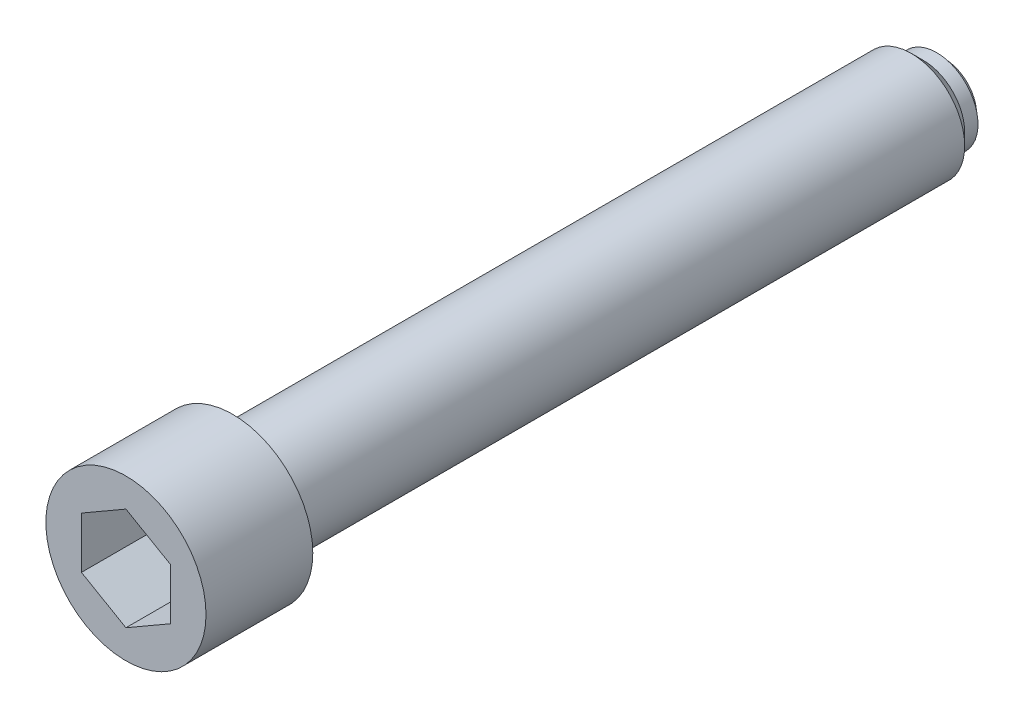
ISO-10303-21;
HEADER;
FILE_DESCRIPTION(('STEP AP214'),'2;1');
FILE_NAME('part.step','',(''),(''),'','','');
FILE_SCHEMA(('AUTOMOTIVE_DESIGN { 1 0 10303 214 1 1 1 1 }'));
ENDSEC;
DATA;
#1=APPLICATION_CONTEXT('core data for automotive mechanical design processes');
#2=APPLICATION_PROTOCOL_DEFINITION('international standard','automotive_design',2000,#1);
#3=PRODUCT_CONTEXT('',#1,'mechanical');
#4=PRODUCT('Part','Part','',(#3));
#5=PRODUCT_RELATED_PRODUCT_CATEGORY('part','',(#4));
#6=PRODUCT_DEFINITION_FORMATION('','',#4);
#7=PRODUCT_DEFINITION_CONTEXT('part definition',#1,'design');
#8=PRODUCT_DEFINITION('design','',#6,#7);
#9=PRODUCT_DEFINITION_SHAPE('','',#8);
#10=(LENGTH_UNIT() NAMED_UNIT(*) SI_UNIT(.MILLI.,.METRE.));
#11=(NAMED_UNIT(*) PLANE_ANGLE_UNIT() SI_UNIT($,.RADIAN.));
#12=(NAMED_UNIT(*) SI_UNIT($,.STERADIAN.) SOLID_ANGLE_UNIT());
#13=UNCERTAINTY_MEASURE_WITH_UNIT(LENGTH_MEASURE(1.E-05),#10,'distance_accuracy_value','');
#14=(GEOMETRIC_REPRESENTATION_CONTEXT(3) GLOBAL_UNCERTAINTY_ASSIGNED_CONTEXT((#13)) GLOBAL_UNIT_ASSIGNED_CONTEXT((#10,
#11,#12)) REPRESENTATION_CONTEXT('',''));
#15=CARTESIAN_POINT('',(0.,0.,0.));
#16=DIRECTION('',(0.,0.,1.));
#17=DIRECTION('',(1.,0.,0.));
#18=AXIS2_PLACEMENT_3D('',#15,#16,#17);
#19=CARTESIAN_POINT('',(0.,0.,2.25887139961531));
#20=DIRECTION('',(0.,0.,1.));
#21=DIRECTION('',(-1.,0.,0.));
#22=AXIS2_PLACEMENT_3D('',#19,#20,#21);
#23=SPHERICAL_SURFACE('',#22,4.25);
#24=CARTESIAN_POINT('',(0.,0.,0.9));
#25=DIRECTION('',(0.,0.,1.));
#26=DIRECTION('',(1.,0.,0.));
#27=AXIS2_PLACEMENT_3D('',#24,#25,#26);
#28=CIRCLE('',#27,4.02690557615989);
#29=CARTESIAN_POINT('',(-4.02690557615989,0.,0.9));
#30=VERTEX_POINT('',#29);
#31=EDGE_CURVE('E132',#30,#30,#28,.T.);
#32=CARTESIAN_POINT('',(0.,0.,0.));
#33=DIRECTION('',(0.,0.,1.));
#34=DIRECTION('',(1.,0.,0.));
#35=AXIS2_PLACEMENT_3D('',#32,#33,#34);
#36=CIRCLE('',#35,3.6);
#37=CARTESIAN_POINT('',(-3.60000000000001,0.,0.));
#38=VERTEX_POINT('',#37);
#39=EDGE_CURVE('E10',#38,#38,#36,.T.);
#40=CARTESIAN_POINT('',(-4.02690557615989,0.,0.9));
#41=CARTESIAN_POINT('',(-4.02358030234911,0.,0.890145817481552));
#42=CARTESIAN_POINT('',(-4.0202188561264,0.,0.880303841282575));
#43=CARTESIAN_POINT('',(-4.01342380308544,0.,0.860644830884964));
#44=CARTESIAN_POINT('',(-4.00999019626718,0.,0.850827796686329));
#45=CARTESIAN_POINT('',(-4.00305100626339,0.,0.831219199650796));
#46=CARTESIAN_POINT('',(-3.99954542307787,0.,0.821427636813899));
#47=CARTESIAN_POINT('',(-3.99246246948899,0.,0.801870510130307));
#48=CARTESIAN_POINT('',(-3.98888509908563,0.,0.792104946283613));
#49=CARTESIAN_POINT('',(-3.98165876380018,0.,0.772600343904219));
#50=CARTESIAN_POINT('',(-3.97800979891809,0.,0.76286130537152));
#51=CARTESIAN_POINT('',(-3.97064047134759,0.,0.743410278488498));
#52=CARTESIAN_POINT('',(-3.96692010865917,0.,0.733698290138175));
#53=CARTESIAN_POINT('',(-3.95940818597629,0.,0.714301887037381));
#54=CARTESIAN_POINT('',(-3.95561662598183,0.,0.704617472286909));
#55=CARTESIAN_POINT('',(-3.94796251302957,0.,0.685276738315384));
#56=CARTESIAN_POINT('',(-3.94409996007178,0.,0.675620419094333));
#57=CARTESIAN_POINT('',(-3.93630406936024,0.,0.656336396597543));
#58=CARTESIAN_POINT('',(-3.9323707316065,0.,0.646708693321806));
#59=CARTESIAN_POINT('',(-3.92443348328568,0.,0.627482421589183));
#60=CARTESIAN_POINT('',(-3.92042957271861,0.,0.617883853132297));
#61=CARTESIAN_POINT('',(-3.91235139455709,0.,0.598716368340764));
#62=CARTESIAN_POINT('',(-3.90827712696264,0.,0.589147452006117));
#63=CARTESIAN_POINT('',(-3.90005845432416,0.,0.570039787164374));
#64=CARTESIAN_POINT('',(-3.89591404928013,0.,0.560501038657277));
#65=CARTESIAN_POINT('',(-3.88755532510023,0.,0.54145422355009));
#66=CARTESIAN_POINT('',(-3.88334100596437,0.,0.53194615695));
#67=CARTESIAN_POINT('',(-3.87484268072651,0.,0.512961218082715));
#68=CARTESIAN_POINT('',(-3.87055867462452,0.,0.503484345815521));
#69=CARTESIAN_POINT('',(-3.86192120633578,0.,0.484562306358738));
#70=CARTESIAN_POINT('',(-3.85756774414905,0.,0.475117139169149));
#71=CARTESIAN_POINT('',(-3.84879159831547,0.,0.456259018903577));
#72=CARTESIAN_POINT('',(-3.84436891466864,0.,0.446846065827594));
#73=CARTESIAN_POINT('',(-3.83545456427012,0.,0.428052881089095));
#74=CARTESIAN_POINT('',(-3.83096289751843,0.,0.418672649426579));
#75=CARTESIAN_POINT('',(-3.82191082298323,0.,0.399945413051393));
#76=CARTESIAN_POINT('',(-3.81735041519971,0.,0.390598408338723));
#77=CARTESIAN_POINT('',(-3.80816110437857,0.,0.371938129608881));
#78=CARTESIAN_POINT('',(-3.80353220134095,0.,0.362624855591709));
#79=CARTESIAN_POINT('',(-3.7942061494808,0.,0.344032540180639));
#80=CARTESIAN_POINT('',(-3.78950900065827,0.,0.334753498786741));
#81=CARTESIAN_POINT('',(-3.78004671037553,0.,0.31623014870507));
#82=CARTESIAN_POINT('',(-3.77528156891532,0.,0.306985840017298));
#83=CARTESIAN_POINT('',(-3.76568355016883,0.,0.288532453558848));
#84=CARTESIAN_POINT('',(-3.76085067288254,0.,0.279323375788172));
#85=CARTESIAN_POINT('',(-3.75111744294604,0.,0.260940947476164));
#86=CARTESIAN_POINT('',(-3.74621709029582,0.,0.251767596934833));
#87=CARTESIAN_POINT('',(-3.73634917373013,0.,0.233457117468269));
#88=CARTESIAN_POINT('',(-3.73138160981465,0.,0.224319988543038));
#89=CARTESIAN_POINT('',(-3.72137953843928,0.,0.206082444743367));
#90=CARTESIAN_POINT('',(-3.71634503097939,0.,0.196982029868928));
#91=CARTESIAN_POINT('',(-3.70620934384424,0.,0.178818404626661));
#92=CARTESIAN_POINT('',(-3.70110816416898,0.,0.169755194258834));
#93=CARTESIAN_POINT('',(-3.69083940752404,0.,0.151666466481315));
#94=CARTESIAN_POINT('',(-3.68567183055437,0.,0.142640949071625));
#95=CARTESIAN_POINT('',(-3.67527055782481,0.,0.124628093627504));
#96=CARTESIAN_POINT('',(-3.67003686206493,0.,0.115640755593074));
#97=CARTESIAN_POINT('',(-3.6595036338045,0.,0.0977047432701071));
#98=CARTESIAN_POINT('',(-3.65420410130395,0.,0.0887560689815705));
#99=CARTESIAN_POINT('',(-3.64353948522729,0.,0.0708978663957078));
#100=CARTESIAN_POINT('',(-3.63817440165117,0.,0.0619883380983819));
#101=CARTESIAN_POINT('',(-3.62737897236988,0.,0.0442089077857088));
#102=CARTESIAN_POINT('',(-3.62194862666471,0.,0.0353390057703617));
#103=CARTESIAN_POINT('',(-3.61102296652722,0.,0.0176393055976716));
#104=CARTESIAN_POINT('',(-3.60552765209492,0.,0.00880950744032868));
#105=CARTESIAN_POINT('',(-3.60000000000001,0.,0.));
#106=B_SPLINE_CURVE_WITH_KNOTS('',3,(#40,#41,#42,#43,#44,#45,#46,#47,#48,#49,#50,#51,#52,#53,
#54,#55,#56,#57,#58,#59,#60,#61,#62,#63,#64,#65,#66,#67,#68,#69,#70,#71,#72,#73,#74,#75,#76,#77,
#78,#79,#80,#81,#82,#83,#84,#85,#86,#87,#88,#89,#90,#91,#92,#93,#94,#95,#96,#97,#98,#99,#100,
#101,#102,#103,#104,#105),.UNSPECIFIED.,.F.,.F.,(4,2,2,2,2,2,2,2,2,2,2,2,2,2,2,2,2,2,2,2,2,2,2,
2,2,2,2,2,2,2,2,2,4),(0.,0.0312002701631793,0.0624005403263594,0.0936008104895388,
0.124801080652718,0.156001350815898,0.187201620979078,0.218401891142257,0.249602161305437,
0.280802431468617,0.312002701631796,0.343202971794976,0.374403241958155,0.405603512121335,
0.436803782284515,0.468004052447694,0.499204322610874,0.530404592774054,0.561604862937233,
0.592805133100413,0.624005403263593,0.655205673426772,0.686405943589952,0.717606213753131,
0.748806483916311,0.780006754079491,0.811207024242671,0.84240729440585,0.87360756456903,
0.904807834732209,0.936008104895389,0.967208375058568,0.998408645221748),.UNSPECIFIED.);
#107=EDGE_CURVE('BSEAM16',#30,#38,#106,.T.);
#108=ORIENTED_EDGE('',*,*,#31,.F.);
#109=ORIENTED_EDGE('',*,*,#39,.T.);
#110=ORIENTED_EDGE('',*,*,#107,.T.);
#111=ORIENTED_EDGE('',*,*,#107,.F.);
#112=EDGE_LOOP('',(#108,#110,#109,#111));
#113=FACE_BOUND('',#112,.T.);
#114=ADVANCED_FACE('F16',(#113),#23,.T.);
#115=CARTESIAN_POINT('',(0.,0.,0.));
#116=DIRECTION('',(0.,0.,1.));
#117=DIRECTION('',(1.,0.,0.));
#118=AXIS2_PLACEMENT_3D('',#115,#116,#117);
#119=PLANE('',#118);
#120=ORIENTED_EDGE('',*,*,#39,.F.);
#121=EDGE_LOOP('',(#120));
#122=FACE_BOUND('',#121,.T.);
#123=ADVANCED_FACE('F208',(#122),#119,.F.);
#124=CARTESIAN_POINT('',(-9.,0.,92.));
#125=DIRECTION('',(0.,0.,-1.));
#126=DIRECTION('',(-1.,0.,0.));
#127=AXIS2_PLACEMENT_3D('',#124,#125,#126);
#128=PLANE('',#127);
#129=DIRECTION('',(-0.866025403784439,-0.5,0.));
#130=VECTOR('',#129,1.);
#131=CARTESIAN_POINT('',(0.,5.77350269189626,92.));
#132=LINE('',#131,#130);
#133=CARTESIAN_POINT('',(0.,5.77350269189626,92.));
#134=VERTEX_POINT('',#133);
#135=CARTESIAN_POINT('',(-5.,2.88675134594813,92.));
#136=VERTEX_POINT('',#135);
#137=EDGE_CURVE('E113',#134,#136,#132,.T.);
#138=ORIENTED_EDGE('',*,*,#137,.F.);
#139=DIRECTION('',(-0.866025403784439,0.5,0.));
#140=VECTOR('',#139,1.);
#141=CARTESIAN_POINT('',(5.,2.88675134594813,92.));
#142=LINE('',#141,#140);
#143=CARTESIAN_POINT('',(5.,2.88675134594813,92.));
#144=VERTEX_POINT('',#143);
#145=EDGE_CURVE('E31',#144,#134,#142,.T.);
#146=ORIENTED_EDGE('',*,*,#145,.F.);
#147=DIRECTION('',(0.,1.,0.));
#148=VECTOR('',#147,1.);
#149=CARTESIAN_POINT('',(5.,-2.88675134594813,92.));
#150=LINE('',#149,#148);
#151=CARTESIAN_POINT('',(5.,-2.88675134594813,92.));
#152=VERTEX_POINT('',#151);
#153=EDGE_CURVE('E126',#152,#144,#150,.T.);
#154=ORIENTED_EDGE('',*,*,#153,.F.);
#155=DIRECTION('',(0.866025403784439,0.5,0.));
#156=VECTOR('',#155,1.);
#157=CARTESIAN_POINT('',(0.,-5.77350269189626,92.));
#158=LINE('',#157,#156);
#159=CARTESIAN_POINT('',(0.,-5.77350269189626,92.));
#160=VERTEX_POINT('',#159);
#161=EDGE_CURVE('E123',#160,#152,#158,.T.);
#162=ORIENTED_EDGE('',*,*,#161,.F.);
#163=DIRECTION('',(0.866025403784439,-0.5,0.));
#164=VECTOR('',#163,1.);
#165=CARTESIAN_POINT('',(-5.,-2.88675134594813,92.));
#166=LINE('',#165,#164);
#167=CARTESIAN_POINT('',(-5.,-2.88675134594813,92.));
#168=VERTEX_POINT('',#167);
#169=EDGE_CURVE('E79',#168,#160,#166,.T.);
#170=ORIENTED_EDGE('',*,*,#169,.F.);
#171=DIRECTION('',(0.,-1.,0.));
#172=VECTOR('',#171,1.);
#173=CARTESIAN_POINT('',(-5.,2.88675134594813,92.));
#174=LINE('',#173,#172);
#175=EDGE_CURVE('E117',#136,#168,#174,.T.);
#176=ORIENTED_EDGE('',*,*,#175,.F.);
#177=EDGE_LOOP('',(#138,#146,#154,#162,#170,#176));
#178=FACE_BOUND('',#177,.T.);
#179=CARTESIAN_POINT('',(0.,0.,92.));
#180=DIRECTION('',(0.,0.,1.));
#181=DIRECTION('',(1.,0.,0.));
#182=AXIS2_PLACEMENT_3D('',#179,#180,#181);
#183=CIRCLE('',#182,9.);
#184=CARTESIAN_POINT('',(9.,0.,92.));
#185=VERTEX_POINT('',#184);
#186=EDGE_CURVE('E24',#185,#185,#183,.T.);
#187=ORIENTED_EDGE('',*,*,#186,.T.);
#188=EDGE_LOOP('',(#187));
#189=FACE_BOUND('',#188,.T.);
#190=ADVANCED_FACE('F167',(#178,#189),#128,.F.);
#191=CARTESIAN_POINT('',(0.,0.,0.));
#192=DIRECTION('',(0.,0.,1.));
#193=DIRECTION('',(1.,0.,0.));
#194=AXIS2_PLACEMENT_3D('',#191,#192,#193);
#195=CYLINDRICAL_SURFACE('',#194,9.);
#196=ORIENTED_EDGE('',*,*,#186,.F.);
#197=EDGE_LOOP('',(#196));
#198=FACE_BOUND('',#197,.T.);
#199=CARTESIAN_POINT('',(0.,0.,80.));
#200=DIRECTION('',(0.,0.,1.));
#201=DIRECTION('',(1.,0.,0.));
#202=AXIS2_PLACEMENT_3D('',#199,#200,#201);
#203=CIRCLE('',#202,9.);
#204=CARTESIAN_POINT('',(9.,0.,80.));
#205=VERTEX_POINT('',#204);
#206=EDGE_CURVE('E160',#205,#205,#203,.T.);
#207=ORIENTED_EDGE('',*,*,#206,.T.);
#208=EDGE_LOOP('',(#207));
#209=FACE_BOUND('',#208,.T.);
#210=ADVANCED_FACE('F169',(#198,#209),#195,.T.);
#211=CARTESIAN_POINT('',(-6.,0.,80.));
#212=DIRECTION('',(0.,0.,1.));
#213=DIRECTION('',(1.,0.,0.));
#214=AXIS2_PLACEMENT_3D('',#211,#212,#213);
#215=PLANE('',#214);
#216=ORIENTED_EDGE('',*,*,#206,.F.);
#217=EDGE_LOOP('',(#216));
#218=FACE_BOUND('',#217,.T.);
#219=CARTESIAN_POINT('',(0.,0.,80.));
#220=DIRECTION('',(0.,0.,1.));
#221=DIRECTION('',(1.,0.,0.));
#222=AXIS2_PLACEMENT_3D('',#219,#220,#221);
#223=CIRCLE('',#222,6.);
#224=CARTESIAN_POINT('',(6.,0.,80.));
#225=VERTEX_POINT('',#224);
#226=EDGE_CURVE('E156',#225,#225,#223,.T.);
#227=ORIENTED_EDGE('',*,*,#226,.T.);
#228=EDGE_LOOP('',(#227));
#229=FACE_BOUND('',#228,.T.);
#230=ADVANCED_FACE('F172',(#218,#229),#215,.F.);
#231=CARTESIAN_POINT('',(0.,0.,0.));
#232=DIRECTION('',(0.,0.,1.));
#233=DIRECTION('',(1.,0.,0.));
#234=AXIS2_PLACEMENT_3D('',#231,#232,#233);
#235=CYLINDRICAL_SURFACE('',#234,6.);
#236=ORIENTED_EDGE('',*,*,#226,.F.);
#237=EDGE_LOOP('',(#236));
#238=FACE_BOUND('',#237,.T.);
#239=CARTESIAN_POINT('',(0.,0.,3.75));
#240=DIRECTION('',(0.,0.,1.));
#241=DIRECTION('',(1.,0.,0.));
#242=AXIS2_PLACEMENT_3D('',#239,#240,#241);
#243=CIRCLE('',#242,6.);
#244=CARTESIAN_POINT('',(6.,0.,3.75));
#245=VERTEX_POINT('',#244);
#246=EDGE_CURVE('E152',#245,#245,#243,.T.);
#247=ORIENTED_EDGE('',*,*,#246,.T.);
#248=EDGE_LOOP('',(#247));
#249=FACE_BOUND('',#248,.T.);
#250=ADVANCED_FACE('F178',(#238,#249),#235,.T.);
#251=CARTESIAN_POINT('',(0.,0.,2.4));
#252=DIRECTION('',(0.,0.,1.));
#253=DIRECTION('',(1.,0.,0.));
#254=AXIS2_PLACEMENT_3D('',#251,#252,#253);
#255=CONICAL_SURFACE('',#254,4.65,0.785398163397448);
#256=ORIENTED_EDGE('',*,*,#246,.F.);
#257=EDGE_LOOP('',(#256));
#258=FACE_BOUND('',#257,.T.);
#259=CARTESIAN_POINT('',(0.,0.,2.4));
#260=DIRECTION('',(0.,0.,1.));
#261=DIRECTION('',(1.,0.,0.));
#262=AXIS2_PLACEMENT_3D('',#259,#260,#261);
#263=CIRCLE('',#262,4.65);
#264=CARTESIAN_POINT('',(4.65,0.,2.4));
#265=VERTEX_POINT('',#264);
#266=EDGE_CURVE('E148',#265,#265,#263,.T.);
#267=ORIENTED_EDGE('',*,*,#266,.T.);
#268=EDGE_LOOP('',(#267));
#269=FACE_BOUND('',#268,.T.);
#270=ADVANCED_FACE('F184',(#258,#269),#255,.T.);
#271=CARTESIAN_POINT('',(0.,0.,0.));
#272=DIRECTION('',(0.,0.,1.));
#273=DIRECTION('',(1.,0.,0.));
#274=AXIS2_PLACEMENT_3D('',#271,#272,#273);
#275=CYLINDRICAL_SURFACE('',#274,4.65);
#276=ORIENTED_EDGE('',*,*,#266,.F.);
#277=EDGE_LOOP('',(#276));
#278=FACE_BOUND('',#277,.T.);
#279=CARTESIAN_POINT('',(0.,0.,0.9));
#280=DIRECTION('',(0.,0.,1.));
#281=DIRECTION('',(1.,0.,0.));
#282=AXIS2_PLACEMENT_3D('',#279,#280,#281);
#283=CIRCLE('',#282,4.65);
#284=CARTESIAN_POINT('',(4.65,0.,0.9));
#285=VERTEX_POINT('',#284);
#286=EDGE_CURVE('E144',#285,#285,#283,.T.);
#287=ORIENTED_EDGE('',*,*,#286,.T.);
#288=EDGE_LOOP('',(#287));
#289=FACE_BOUND('',#288,.T.);
#290=ADVANCED_FACE('F190',(#278,#289),#275,.T.);
#291=CARTESIAN_POINT('',(-4.02690557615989,0.,0.9));
#292=DIRECTION('',(0.,0.,1.));
#293=DIRECTION('',(1.,0.,0.));
#294=AXIS2_PLACEMENT_3D('',#291,#292,#293);
#295=PLANE('',#294);
#296=ORIENTED_EDGE('',*,*,#286,.F.);
#297=EDGE_LOOP('',(#296));
#298=FACE_BOUND('',#297,.T.);
#299=ORIENTED_EDGE('',*,*,#31,.T.);
#300=EDGE_LOOP('',(#299));
#301=FACE_BOUND('',#300,.T.);
#302=ADVANCED_FACE('F196',(#298,#301),#295,.F.);
#303=CARTESIAN_POINT('',(5.,2.88675134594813,84.5));
#304=DIRECTION('',(0.5,0.866025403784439,0.));
#305=DIRECTION('',(-0.866025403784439,0.5,0.));
#306=AXIS2_PLACEMENT_3D('',#303,#304,#305);
#307=PLANE('',#306);
#308=ORIENTED_EDGE('',*,*,#145,.T.);
#309=DIRECTION('',(0.,0.,1.));
#310=VECTOR('',#309,1.);
#311=CARTESIAN_POINT('',(0.,5.77350269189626,84.5));
#312=LINE('',#311,#310);
#313=CARTESIAN_POINT('',(0.,5.77350269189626,84.5));
#314=VERTEX_POINT('',#313);
#315=EDGE_CURVE('E61',#314,#134,#312,.T.);
#316=ORIENTED_EDGE('',*,*,#315,.F.);
#317=DIRECTION('',(-0.866025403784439,0.5,0.));
#318=VECTOR('',#317,1.);
#319=CARTESIAN_POINT('',(5.,2.88675134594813,84.5));
#320=LINE('',#319,#318);
#321=CARTESIAN_POINT('',(5.,2.88675134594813,84.5));
#322=VERTEX_POINT('',#321);
#323=EDGE_CURVE('E129',#322,#314,#320,.T.);
#324=ORIENTED_EDGE('',*,*,#323,.F.);
#325=DIRECTION('',(0.,0.,1.));
#326=VECTOR('',#325,1.);
#327=CARTESIAN_POINT('',(5.,2.88675134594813,84.5));
#328=LINE('',#327,#326);
#329=EDGE_CURVE('E39',#322,#144,#328,.T.);
#330=ORIENTED_EDGE('',*,*,#329,.T.);
#331=EDGE_LOOP('',(#308,#316,#324,#330));
#332=FACE_BOUND('',#331,.T.);
#333=ADVANCED_FACE('F202',(#332),#307,.F.);
#334=CARTESIAN_POINT('',(5.,-2.88675134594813,84.5));
#335=DIRECTION('',(1.,0.,0.));
#336=DIRECTION('',(0.,1.,0.));
#337=AXIS2_PLACEMENT_3D('',#334,#335,#336);
#338=PLANE('',#337);
#339=ORIENTED_EDGE('',*,*,#153,.T.);
#340=ORIENTED_EDGE('',*,*,#329,.F.);
#341=DIRECTION('',(0.,1.,0.));
#342=VECTOR('',#341,1.);
#343=CARTESIAN_POINT('',(5.,-2.88675134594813,84.5));
#344=LINE('',#343,#342);
#345=CARTESIAN_POINT('',(5.,-2.88675134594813,84.5));
#346=VERTEX_POINT('',#345);
#347=EDGE_CURVE('E93',#346,#322,#344,.T.);
#348=ORIENTED_EDGE('',*,*,#347,.F.);
#349=DIRECTION('',(0.,0.,1.));
#350=VECTOR('',#349,1.);
#351=CARTESIAN_POINT('',(5.,-2.88675134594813,84.5));
#352=LINE('',#351,#350);
#353=EDGE_CURVE('E84',#346,#152,#352,.T.);
#354=ORIENTED_EDGE('',*,*,#353,.T.);
#355=EDGE_LOOP('',(#339,#340,#348,#354));
#356=FACE_BOUND('',#355,.T.);
#357=ADVANCED_FACE('F222',(#356),#338,.F.);
#358=CARTESIAN_POINT('',(0.,-5.77350269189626,84.5));
#359=DIRECTION('',(0.5,-0.866025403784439,0.));
#360=DIRECTION('',(0.866025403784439,0.5,0.));
#361=AXIS2_PLACEMENT_3D('',#358,#359,#360);
#362=PLANE('',#361);
#363=ORIENTED_EDGE('',*,*,#161,.T.);
#364=ORIENTED_EDGE('',*,*,#353,.F.);
#365=DIRECTION('',(0.866025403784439,0.5,0.));
#366=VECTOR('',#365,1.);
#367=CARTESIAN_POINT('',(0.,-5.77350269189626,84.5));
#368=LINE('',#367,#366);
#369=CARTESIAN_POINT('',(0.,-5.77350269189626,84.5));
#370=VERTEX_POINT('',#369);
#371=EDGE_CURVE('E88',#370,#346,#368,.T.);
#372=ORIENTED_EDGE('',*,*,#371,.F.);
#373=DIRECTION('',(0.,0.,1.));
#374=VECTOR('',#373,1.);
#375=CARTESIAN_POINT('',(0.,-5.77350269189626,84.5));
#376=LINE('',#375,#374);
#377=EDGE_CURVE('E72',#370,#160,#376,.T.);
#378=ORIENTED_EDGE('',*,*,#377,.T.);
#379=EDGE_LOOP('',(#363,#364,#372,#378));
#380=FACE_BOUND('',#379,.T.);
#381=ADVANCED_FACE('F89',(#380),#362,.F.);
#382=CARTESIAN_POINT('',(-5.,-2.88675134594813,84.5));
#383=DIRECTION('',(-0.5,-0.866025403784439,0.));
#384=DIRECTION('',(0.866025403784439,-0.5,0.));
#385=AXIS2_PLACEMENT_3D('',#382,#383,#384);
#386=PLANE('',#385);
#387=ORIENTED_EDGE('',*,*,#169,.T.);
#388=ORIENTED_EDGE('',*,*,#377,.F.);
#389=DIRECTION('',(0.866025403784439,-0.5,0.));
#390=VECTOR('',#389,1.);
#391=CARTESIAN_POINT('',(-5.,-2.88675134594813,84.5));
#392=LINE('',#391,#390);
#393=CARTESIAN_POINT('',(-5.,-2.88675134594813,84.5));
#394=VERTEX_POINT('',#393);
#395=EDGE_CURVE('E76',#394,#370,#392,.T.);
#396=ORIENTED_EDGE('',*,*,#395,.F.);
#397=DIRECTION('',(0.,0.,1.));
#398=VECTOR('',#397,1.);
#399=CARTESIAN_POINT('',(-5.,-2.88675134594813,84.5));
#400=LINE('',#399,#398);
#401=EDGE_CURVE('E85',#394,#168,#400,.T.);
#402=ORIENTED_EDGE('',*,*,#401,.T.);
#403=EDGE_LOOP('',(#387,#388,#396,#402));
#404=FACE_BOUND('',#403,.T.);
#405=ADVANCED_FACE('F74',(#404),#386,.F.);
#406=CARTESIAN_POINT('',(-5.,2.88675134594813,84.5));
#407=DIRECTION('',(-1.,0.,0.));
#408=DIRECTION('',(0.,0.,1.));
#409=AXIS2_PLACEMENT_3D('',#406,#407,#408);
#410=PLANE('',#409);
#411=ORIENTED_EDGE('',*,*,#175,.T.);
#412=ORIENTED_EDGE('',*,*,#401,.F.);
#413=DIRECTION('',(0.,-1.,0.));
#414=VECTOR('',#413,1.);
#415=CARTESIAN_POINT('',(-5.,2.88675134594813,84.5));
#416=LINE('',#415,#414);
#417=CARTESIAN_POINT('',(-5.,2.88675134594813,84.5));
#418=VERTEX_POINT('',#417);
#419=EDGE_CURVE('E99',#418,#394,#416,.T.);
#420=ORIENTED_EDGE('',*,*,#419,.F.);
#421=DIRECTION('',(0.,0.,1.));
#422=VECTOR('',#421,1.);
#423=CARTESIAN_POINT('',(-5.,2.88675134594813,84.5));
#424=LINE('',#423,#422);
#425=EDGE_CURVE('E137',#418,#136,#424,.T.);
#426=ORIENTED_EDGE('',*,*,#425,.T.);
#427=EDGE_LOOP('',(#411,#412,#420,#426));
#428=FACE_BOUND('',#427,.T.);
#429=ADVANCED_FACE('F226',(#428),#410,.F.);
#430=CARTESIAN_POINT('',(0.,5.77350269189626,84.5));
#431=DIRECTION('',(-0.5,0.866025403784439,0.));
#432=DIRECTION('',(-0.866025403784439,-0.5,0.));
#433=AXIS2_PLACEMENT_3D('',#430,#431,#432);
#434=PLANE('',#433);
#435=ORIENTED_EDGE('',*,*,#137,.T.);
#436=ORIENTED_EDGE('',*,*,#425,.F.);
#437=DIRECTION('',(-0.866025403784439,-0.5,0.));
#438=VECTOR('',#437,1.);
#439=CARTESIAN_POINT('',(0.,5.77350269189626,84.5));
#440=LINE('',#439,#438);
#441=EDGE_CURVE('E106',#314,#418,#440,.T.);
#442=ORIENTED_EDGE('',*,*,#441,.F.);
#443=ORIENTED_EDGE('',*,*,#315,.T.);
#444=EDGE_LOOP('',(#435,#436,#442,#443));
#445=FACE_BOUND('',#444,.T.);
#446=ADVANCED_FACE('F223',(#445),#434,.F.);
#447=CARTESIAN_POINT('',(0.,0.,84.5));
#448=DIRECTION('',(0.,0.,1.));
#449=DIRECTION('',(1.,0.,0.));
#450=AXIS2_PLACEMENT_3D('',#447,#448,#449);
#451=PLANE('',#450);
#452=ORIENTED_EDGE('',*,*,#323,.T.);
#453=ORIENTED_EDGE('',*,*,#441,.T.);
#454=ORIENTED_EDGE('',*,*,#419,.T.);
#455=ORIENTED_EDGE('',*,*,#395,.T.);
#456=ORIENTED_EDGE('',*,*,#371,.T.);
#457=ORIENTED_EDGE('',*,*,#347,.T.);
#458=EDGE_LOOP('',(#452,#453,#454,#455,#456,#457));
#459=FACE_BOUND('',#458,.T.);
#460=ADVANCED_FACE('F96',(#459),#451,.T.);
#461=CLOSED_SHELL('',(#114,#123,#190,#210,#230,#250,#270,#290,#302,#333,#357,#381,#405,#429,
#446,#460));
#462=MANIFOLD_SOLID_BREP('B1',#461);
#463=ADVANCED_BREP_SHAPE_REPRESENTATION('',(#18,#462),#14);
#464=SHAPE_DEFINITION_REPRESENTATION(#9,#463);
ENDSEC;
END-ISO-10303-21;
